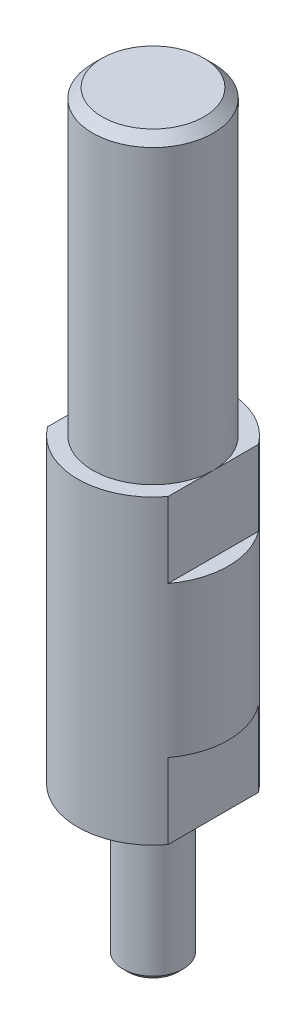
ISO-10303-21;
HEADER;
FILE_DESCRIPTION(('STEP AP214'),'2;1');
FILE_NAME('part.step','',(''),(''),'','','');
FILE_SCHEMA(('AUTOMOTIVE_DESIGN { 1 0 10303 214 1 1 1 1 }'));
ENDSEC;
DATA;
#1=APPLICATION_CONTEXT('core data for automotive mechanical design processes');
#2=APPLICATION_PROTOCOL_DEFINITION('international standard','automotive_design',2000,#1);
#3=PRODUCT_CONTEXT('',#1,'mechanical');
#4=PRODUCT('Part','Part','',(#3));
#5=PRODUCT_RELATED_PRODUCT_CATEGORY('part','',(#4));
#6=PRODUCT_DEFINITION_FORMATION('','',#4);
#7=PRODUCT_DEFINITION_CONTEXT('part definition',#1,'design');
#8=PRODUCT_DEFINITION('design','',#6,#7);
#9=PRODUCT_DEFINITION_SHAPE('','',#8);
#10=(LENGTH_UNIT() NAMED_UNIT(*) SI_UNIT(.MILLI.,.METRE.));
#11=(NAMED_UNIT(*) PLANE_ANGLE_UNIT() SI_UNIT($,.RADIAN.));
#12=(NAMED_UNIT(*) SI_UNIT($,.STERADIAN.) SOLID_ANGLE_UNIT());
#13=UNCERTAINTY_MEASURE_WITH_UNIT(LENGTH_MEASURE(1.E-05),#10,'distance_accuracy_value','');
#14=(GEOMETRIC_REPRESENTATION_CONTEXT(3) GLOBAL_UNCERTAINTY_ASSIGNED_CONTEXT((#13)) GLOBAL_UNIT_ASSIGNED_CONTEXT((#10,
#11,#12)) REPRESENTATION_CONTEXT('',''));
#15=CARTESIAN_POINT('',(0.,0.,0.));
#16=DIRECTION('',(0.,0.,1.));
#17=DIRECTION('',(1.,0.,0.));
#18=AXIS2_PLACEMENT_3D('',#15,#16,#17);
#19=CARTESIAN_POINT('',(0.,-30.,0.));
#20=DIRECTION('',(0.,-1.,0.));
#21=DIRECTION('',(1.,0.,0.));
#22=AXIS2_PLACEMENT_3D('',#19,#20,#21);
#23=CYLINDRICAL_SURFACE('',#22,5.);
#24=CARTESIAN_POINT('',(0.,-20.,0.));
#25=DIRECTION('',(0.,-1.,0.));
#26=DIRECTION('',(1.,0.,0.));
#27=AXIS2_PLACEMENT_3D('',#24,#25,#26);
#28=CIRCLE('',#27,5.);
#29=CARTESIAN_POINT('',(4.,-20.,3.));
#30=VERTEX_POINT('',#29);
#31=CARTESIAN_POINT('',(-4.,-20.,2.99999999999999));
#32=VERTEX_POINT('',#31);
#33=EDGE_CURVE('E139',#30,#32,#28,.T.);
#34=ORIENTED_EDGE('',*,*,#33,.F.);
#35=DIRECTION('',(0.,-1.,0.));
#36=VECTOR('',#35,1.);
#37=CARTESIAN_POINT('',(4.,-30.,3.));
#38=LINE('',#37,#36);
#39=CARTESIAN_POINT('',(4.,-15.,3.));
#40=VERTEX_POINT('',#39);
#41=EDGE_CURVE('E231',#30,#40,#38,.F.);
#42=ORIENTED_EDGE('',*,*,#41,.T.);
#43=CARTESIAN_POINT('',(0.,-15.,0.));
#44=DIRECTION('',(0.,-1.,0.));
#45=DIRECTION('',(1.,0.,0.));
#46=AXIS2_PLACEMENT_3D('',#43,#44,#45);
#47=CIRCLE('',#46,5.);
#48=CARTESIAN_POINT('',(4.,-15.,-3.));
#49=VERTEX_POINT('',#48);
#50=EDGE_CURVE('E159',#40,#49,#47,.F.);
#51=ORIENTED_EDGE('',*,*,#50,.T.);
#52=DIRECTION('',(0.,-1.,0.));
#53=VECTOR('',#52,1.);
#54=CARTESIAN_POINT('',(4.,-30.,-3.));
#55=LINE('',#54,#53);
#56=CARTESIAN_POINT('',(4.,-20.,-3.));
#57=VERTEX_POINT('',#56);
#58=EDGE_CURVE('E234',#49,#57,#55,.T.);
#59=ORIENTED_EDGE('',*,*,#58,.T.);
#60=CARTESIAN_POINT('',(-4.,-20.,-2.99999999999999));
#61=VERTEX_POINT('',#60);
#62=EDGE_CURVE('E144',#61,#57,#28,.T.);
#63=ORIENTED_EDGE('',*,*,#62,.F.);
#64=DIRECTION('',(0.,-1.,0.));
#65=VECTOR('',#64,1.);
#66=CARTESIAN_POINT('',(-4.,-30.,-3.));
#67=LINE('',#66,#65);
#68=CARTESIAN_POINT('',(-4.,-15.,-3.));
#69=VERTEX_POINT('',#68);
#70=EDGE_CURVE('E238',#61,#69,#67,.F.);
#71=ORIENTED_EDGE('',*,*,#70,.T.);
#72=CARTESIAN_POINT('',(-4.,-15.,2.99999999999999));
#73=VERTEX_POINT('',#72);
#74=EDGE_CURVE('E157',#69,#73,#47,.F.);
#75=ORIENTED_EDGE('',*,*,#74,.T.);
#76=DIRECTION('',(0.,-1.,0.));
#77=VECTOR('',#76,1.);
#78=CARTESIAN_POINT('',(-4.,-30.,2.99999999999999));
#79=LINE('',#78,#77);
#80=EDGE_CURVE('E240',#73,#32,#79,.T.);
#81=ORIENTED_EDGE('',*,*,#80,.T.);
#82=EDGE_LOOP('',(#34,#42,#51,#59,#63,#71,#75,#81));
#83=FACE_BOUND('',#82,.T.);
#84=CARTESIAN_POINT('',(0.,-5.,0.));
#85=DIRECTION('',(0.,1.,0.));
#86=DIRECTION('',(-1.,0.,0.));
#87=AXIS2_PLACEMENT_3D('',#84,#85,#86);
#88=CIRCLE('',#87,5.);
#89=CARTESIAN_POINT('',(4.,-5.,-3.));
#90=VERTEX_POINT('',#89);
#91=CARTESIAN_POINT('',(4.,-5.,3.));
#92=VERTEX_POINT('',#91);
#93=EDGE_CURVE('E164',#90,#92,#88,.F.);
#94=ORIENTED_EDGE('',*,*,#93,.T.);
#95=DIRECTION('',(0.,-1.,0.));
#96=VECTOR('',#95,1.);
#97=CARTESIAN_POINT('',(4.00000000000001,-30.,3.));
#98=LINE('',#97,#96);
#99=CARTESIAN_POINT('',(4.,0.,3.));
#100=VERTEX_POINT('',#99);
#101=EDGE_CURVE('E249',#92,#100,#98,.F.);
#102=ORIENTED_EDGE('',*,*,#101,.T.);
#103=CARTESIAN_POINT('',(0.,0.,0.));
#104=DIRECTION('',(0.,-1.,0.));
#105=DIRECTION('',(1.,0.,0.));
#106=AXIS2_PLACEMENT_3D('',#103,#104,#105);
#107=CIRCLE('',#106,5.);
#108=CARTESIAN_POINT('',(-4.,0.,3.));
#109=VERTEX_POINT('',#108);
#110=EDGE_CURVE('E138',#100,#109,#107,.T.);
#111=ORIENTED_EDGE('',*,*,#110,.T.);
#112=DIRECTION('',(0.,-1.,0.));
#113=VECTOR('',#112,1.);
#114=CARTESIAN_POINT('',(-3.99999999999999,-30.,3.));
#115=LINE('',#114,#113);
#116=CARTESIAN_POINT('',(-4.,-5.,3.));
#117=VERTEX_POINT('',#116);
#118=EDGE_CURVE('E70',#109,#117,#115,.T.);
#119=ORIENTED_EDGE('',*,*,#118,.T.);
#120=CARTESIAN_POINT('',(-4.,-5.,-3.));
#121=VERTEX_POINT('',#120);
#122=EDGE_CURVE('E135',#117,#121,#88,.F.);
#123=ORIENTED_EDGE('',*,*,#122,.T.);
#124=DIRECTION('',(0.,-1.,0.));
#125=VECTOR('',#124,1.);
#126=CARTESIAN_POINT('',(-3.99999999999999,-30.,-3.));
#127=LINE('',#126,#125);
#128=CARTESIAN_POINT('',(-4.,0.,-3.));
#129=VERTEX_POINT('',#128);
#130=EDGE_CURVE('E121',#121,#129,#127,.F.);
#131=ORIENTED_EDGE('',*,*,#130,.T.);
#132=CARTESIAN_POINT('',(4.,0.,-3.));
#133=VERTEX_POINT('',#132);
#134=EDGE_CURVE('E134',#129,#133,#107,.T.);
#135=ORIENTED_EDGE('',*,*,#134,.T.);
#136=DIRECTION('',(0.,-1.,0.));
#137=VECTOR('',#136,1.);
#138=CARTESIAN_POINT('',(4.00000000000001,-30.,-3.));
#139=LINE('',#138,#137);
#140=EDGE_CURVE('E62',#133,#90,#139,.T.);
#141=ORIENTED_EDGE('',*,*,#140,.T.);
#142=EDGE_LOOP('',(#94,#102,#111,#119,#123,#131,#135,#141));
#143=FACE_BOUND('',#142,.T.);
#144=ADVANCED_FACE('F47',(#83,#143),#23,.T.);
#145=CARTESIAN_POINT('',(4.,0.,0.));
#146=DIRECTION('',(0.,1.,0.));
#147=DIRECTION('',(-1.,0.,0.));
#148=AXIS2_PLACEMENT_3D('',#145,#146,#147);
#149=PLANE('',#148);
#150=ORIENTED_EDGE('',*,*,#110,.F.);
#151=DIRECTION('',(0.,0.,-1.));
#152=VECTOR('',#151,1.);
#153=CARTESIAN_POINT('',(4.,0.,0.));
#154=LINE('',#153,#152);
#155=CARTESIAN_POINT('',(4.,0.,0.));
#156=VERTEX_POINT('',#155);
#157=EDGE_CURVE('E162',#100,#156,#154,.T.);
#158=ORIENTED_EDGE('',*,*,#157,.T.);
#159=CARTESIAN_POINT('',(0.,0.,0.));
#160=DIRECTION('',(0.,-1.,0.));
#161=DIRECTION('',(1.,0.,0.));
#162=AXIS2_PLACEMENT_3D('',#159,#160,#161);
#163=CIRCLE('',#162,4.);
#164=CARTESIAN_POINT('',(-4.,0.,0.));
#165=VERTEX_POINT('',#164);
#166=EDGE_CURVE('E148',#156,#165,#163,.T.);
#167=ORIENTED_EDGE('',*,*,#166,.T.);
#168=DIRECTION('',(0.,0.,1.));
#169=VECTOR('',#168,1.);
#170=CARTESIAN_POINT('',(-4.,0.,0.));
#171=LINE('',#170,#169);
#172=EDGE_CURVE('E123',#165,#109,#171,.T.);
#173=ORIENTED_EDGE('',*,*,#172,.T.);
#174=EDGE_LOOP('',(#150,#158,#167,#173));
#175=FACE_BOUND('',#174,.T.);
#176=ADVANCED_FACE('F187',(#175),#149,.T.);
#177=EDGE_CURVE('E142',#165,#156,#163,.T.);
#178=ORIENTED_EDGE('',*,*,#177,.T.);
#179=EDGE_CURVE('E128',#156,#133,#154,.T.);
#180=ORIENTED_EDGE('',*,*,#179,.T.);
#181=ORIENTED_EDGE('',*,*,#134,.F.);
#182=EDGE_CURVE('E118',#129,#165,#171,.T.);
#183=ORIENTED_EDGE('',*,*,#182,.T.);
#184=EDGE_LOOP('',(#178,#180,#181,#183));
#185=FACE_BOUND('',#184,.T.);
#186=ADVANCED_FACE('F137',(#185),#149,.T.);
#187=CARTESIAN_POINT('',(5.,-20.,0.));
#188=DIRECTION('',(0.,-1.,0.));
#189=DIRECTION('',(1.,0.,0.));
#190=AXIS2_PLACEMENT_3D('',#187,#188,#189);
#191=PLANE('',#190);
#192=CARTESIAN_POINT('',(0.,-20.,0.));
#193=DIRECTION('',(0.,-1.,0.));
#194=DIRECTION('',(1.,0.,0.));
#195=AXIS2_PLACEMENT_3D('',#192,#193,#194);
#196=CIRCLE('',#195,2.);
#197=CARTESIAN_POINT('',(2.,-20.,0.));
#198=VERTEX_POINT('',#197);
#199=EDGE_CURVE('E226',#198,#198,#196,.T.);
#200=ORIENTED_EDGE('',*,*,#199,.F.);
#201=EDGE_LOOP('',(#200));
#202=FACE_BOUND('',#201,.T.);
#203=ORIENTED_EDGE('',*,*,#62,.T.);
#204=DIRECTION('',(0.,0.,1.));
#205=VECTOR('',#204,1.);
#206=CARTESIAN_POINT('',(4.,-20.,0.));
#207=LINE('',#206,#205);
#208=EDGE_CURVE('E154',#57,#30,#207,.T.);
#209=ORIENTED_EDGE('',*,*,#208,.T.);
#210=ORIENTED_EDGE('',*,*,#33,.T.);
#211=DIRECTION('',(0.,0.,-1.));
#212=VECTOR('',#211,1.);
#213=CARTESIAN_POINT('',(-4.,-20.,0.));
#214=LINE('',#213,#212);
#215=EDGE_CURVE('E151',#32,#61,#214,.T.);
#216=ORIENTED_EDGE('',*,*,#215,.T.);
#217=EDGE_LOOP('',(#203,#209,#210,#216));
#218=FACE_BOUND('',#217,.T.);
#219=ADVANCED_FACE('F198',(#202,#218),#191,.T.);
#220=CARTESIAN_POINT('',(2.00000000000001,-30.,0.));
#221=DIRECTION('',(0.,-1.,0.));
#222=DIRECTION('',(1.,0.,0.));
#223=AXIS2_PLACEMENT_3D('',#220,#221,#222);
#224=PLANE('',#223);
#225=CARTESIAN_POINT('',(0.,-30.,0.));
#226=DIRECTION('',(0.,-1.,0.));
#227=DIRECTION('',(1.,0.,0.));
#228=AXIS2_PLACEMENT_3D('',#225,#226,#227);
#229=CIRCLE('',#228,1.65);
#230=CARTESIAN_POINT('',(1.65,-30.,0.));
#231=VERTEX_POINT('',#230);
#232=EDGE_CURVE('E165',#231,#231,#229,.T.);
#233=ORIENTED_EDGE('',*,*,#232,.T.);
#234=EDGE_LOOP('',(#233));
#235=FACE_BOUND('',#234,.T.);
#236=ADVANCED_FACE('F207',(#235),#224,.T.);
#237=CARTESIAN_POINT('',(0.,20.,0.));
#238=DIRECTION('',(0.,1.,0.));
#239=DIRECTION('',(-1.,0.,0.));
#240=AXIS2_PLACEMENT_3D('',#237,#238,#239);
#241=PLANE('',#240);
#242=CARTESIAN_POINT('',(0.,20.,0.));
#243=DIRECTION('',(0.,1.,0.));
#244=DIRECTION('',(-1.,0.,0.));
#245=AXIS2_PLACEMENT_3D('',#242,#243,#244);
#246=CIRCLE('',#245,3.37499999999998);
#247=CARTESIAN_POINT('',(-3.37499999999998,20.,0.));
#248=VERTEX_POINT('',#247);
#249=EDGE_CURVE('E12',#248,#248,#246,.T.);
#250=ORIENTED_EDGE('',*,*,#249,.T.);
#251=EDGE_LOOP('',(#250));
#252=FACE_BOUND('',#251,.T.);
#253=ADVANCED_FACE('F204',(#252),#241,.T.);
#254=CARTESIAN_POINT('',(0.,-30.,0.));
#255=DIRECTION('',(0.,-1.,0.));
#256=DIRECTION('',(1.,0.,0.));
#257=AXIS2_PLACEMENT_3D('',#254,#255,#256);
#258=CYLINDRICAL_SURFACE('',#257,4.);
#259=CARTESIAN_POINT('',(0.,19.375,0.));
#260=DIRECTION('',(0.,1.,0.));
#261=DIRECTION('',(-1.,0.,0.));
#262=AXIS2_PLACEMENT_3D('',#259,#260,#261);
#263=CIRCLE('',#262,4.);
#264=CARTESIAN_POINT('',(-4.,19.375,0.));
#265=VERTEX_POINT('',#264);
#266=EDGE_CURVE('E55',#265,#265,#263,.F.);
#267=ORIENTED_EDGE('',*,*,#266,.T.);
#268=EDGE_LOOP('',(#267));
#269=FACE_BOUND('',#268,.T.);
#270=ORIENTED_EDGE('',*,*,#166,.F.);
#271=ORIENTED_EDGE('',*,*,#177,.F.);
#272=EDGE_LOOP('',(#270,#271));
#273=FACE_BOUND('',#272,.T.);
#274=ADVANCED_FACE('F173',(#269,#273),#258,.T.);
#275=CARTESIAN_POINT('',(0.,-30.,0.));
#276=DIRECTION('',(0.,-1.,0.));
#277=DIRECTION('',(1.,0.,0.));
#278=AXIS2_PLACEMENT_3D('',#275,#276,#277);
#279=CYLINDRICAL_SURFACE('',#278,2.);
#280=CARTESIAN_POINT('',(0.,-29.65,0.));
#281=DIRECTION('',(0.,-1.,0.));
#282=DIRECTION('',(1.,0.,0.));
#283=AXIS2_PLACEMENT_3D('',#280,#281,#282);
#284=CIRCLE('',#283,2.);
#285=CARTESIAN_POINT('',(2.00000000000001,-29.65,0.));
#286=VERTEX_POINT('',#285);
#287=EDGE_CURVE('E168',#286,#286,#284,.F.);
#288=ORIENTED_EDGE('',*,*,#287,.T.);
#289=EDGE_LOOP('',(#288));
#290=FACE_BOUND('',#289,.T.);
#291=ORIENTED_EDGE('',*,*,#199,.T.);
#292=EDGE_LOOP('',(#291));
#293=FACE_BOUND('',#292,.T.);
#294=ADVANCED_FACE('F203',(#290,#293),#279,.T.);
#295=CARTESIAN_POINT('',(-4.,-15.,5.35043025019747));
#296=DIRECTION('',(-1.,0.,0.));
#297=DIRECTION('',(0.,-1.,0.));
#298=AXIS2_PLACEMENT_3D('',#295,#296,#297);
#299=PLANE('',#298);
#300=ORIENTED_EDGE('',*,*,#215,.F.);
#301=ORIENTED_EDGE('',*,*,#80,.F.);
#302=DIRECTION('',(0.,0.,-1.));
#303=VECTOR('',#302,1.);
#304=CARTESIAN_POINT('',(-4.,-15.,5.35043025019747));
#305=LINE('',#304,#303);
#306=EDGE_CURVE('E243',#73,#69,#305,.T.);
#307=ORIENTED_EDGE('',*,*,#306,.T.);
#308=ORIENTED_EDGE('',*,*,#70,.F.);
#309=EDGE_LOOP('',(#300,#301,#307,#308));
#310=FACE_BOUND('',#309,.T.);
#311=ADVANCED_FACE('F271',(#310),#299,.T.);
#312=CARTESIAN_POINT('',(0.,-15.,0.));
#313=DIRECTION('',(0.,-1.,0.));
#314=DIRECTION('',(1.,0.,0.));
#315=AXIS2_PLACEMENT_3D('',#312,#313,#314);
#316=PLANE('',#315);
#317=ORIENTED_EDGE('',*,*,#306,.F.);
#318=ORIENTED_EDGE('',*,*,#74,.F.);
#319=EDGE_LOOP('',(#317,#318));
#320=FACE_BOUND('',#319,.T.);
#321=ADVANCED_FACE('F273',(#320),#316,.T.);
#322=DIRECTION('',(0.,0.,1.));
#323=VECTOR('',#322,1.);
#324=CARTESIAN_POINT('',(4.,-15.,5.35043025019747));
#325=LINE('',#324,#323);
#326=EDGE_CURVE('E246',#49,#40,#325,.T.);
#327=ORIENTED_EDGE('',*,*,#326,.F.);
#328=ORIENTED_EDGE('',*,*,#50,.F.);
#329=EDGE_LOOP('',(#327,#328));
#330=FACE_BOUND('',#329,.T.);
#331=ADVANCED_FACE('F277',(#330),#316,.T.);
#332=CARTESIAN_POINT('',(4.,-15.,5.35043025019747));
#333=DIRECTION('',(1.,0.,0.));
#334=DIRECTION('',(0.,1.,0.));
#335=AXIS2_PLACEMENT_3D('',#332,#333,#334);
#336=PLANE('',#335);
#337=ORIENTED_EDGE('',*,*,#208,.F.);
#338=ORIENTED_EDGE('',*,*,#58,.F.);
#339=ORIENTED_EDGE('',*,*,#326,.T.);
#340=ORIENTED_EDGE('',*,*,#41,.F.);
#341=EDGE_LOOP('',(#337,#338,#339,#340));
#342=FACE_BOUND('',#341,.T.);
#343=ADVANCED_FACE('F275',(#342),#336,.T.);
#344=CARTESIAN_POINT('',(-4.,-5.,-5.49701738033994));
#345=DIRECTION('',(-1.,0.,0.));
#346=DIRECTION('',(0.,-1.,0.));
#347=AXIS2_PLACEMENT_3D('',#344,#345,#346);
#348=PLANE('',#347);
#349=DIRECTION('',(0.,0.,1.));
#350=VECTOR('',#349,1.);
#351=CARTESIAN_POINT('',(-4.,-5.,-5.49701738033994));
#352=LINE('',#351,#350);
#353=EDGE_CURVE('E254',#121,#117,#352,.T.);
#354=ORIENTED_EDGE('',*,*,#353,.T.);
#355=ORIENTED_EDGE('',*,*,#118,.F.);
#356=ORIENTED_EDGE('',*,*,#172,.F.);
#357=ORIENTED_EDGE('',*,*,#182,.F.);
#358=ORIENTED_EDGE('',*,*,#130,.F.);
#359=EDGE_LOOP('',(#354,#355,#356,#357,#358));
#360=FACE_BOUND('',#359,.T.);
#361=ADVANCED_FACE('F120',(#360),#348,.T.);
#362=CARTESIAN_POINT('',(0.,-5.,0.));
#363=DIRECTION('',(0.,1.,0.));
#364=DIRECTION('',(-1.,0.,0.));
#365=AXIS2_PLACEMENT_3D('',#362,#363,#364);
#366=PLANE('',#365);
#367=ORIENTED_EDGE('',*,*,#353,.F.);
#368=ORIENTED_EDGE('',*,*,#122,.F.);
#369=EDGE_LOOP('',(#367,#368));
#370=FACE_BOUND('',#369,.T.);
#371=ADVANCED_FACE('F262',(#370),#366,.T.);
#372=DIRECTION('',(0.,0.,-1.));
#373=VECTOR('',#372,1.);
#374=CARTESIAN_POINT('',(4.,-5.,-5.49701738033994));
#375=LINE('',#374,#373);
#376=EDGE_CURVE('E256',#92,#90,#375,.T.);
#377=ORIENTED_EDGE('',*,*,#376,.F.);
#378=ORIENTED_EDGE('',*,*,#93,.F.);
#379=EDGE_LOOP('',(#377,#378));
#380=FACE_BOUND('',#379,.T.);
#381=ADVANCED_FACE('F260',(#380),#366,.T.);
#382=CARTESIAN_POINT('',(4.,-5.,-5.49701738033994));
#383=DIRECTION('',(1.,0.,0.));
#384=DIRECTION('',(0.,1.,0.));
#385=AXIS2_PLACEMENT_3D('',#382,#383,#384);
#386=PLANE('',#385);
#387=ORIENTED_EDGE('',*,*,#376,.T.);
#388=ORIENTED_EDGE('',*,*,#140,.F.);
#389=ORIENTED_EDGE('',*,*,#179,.F.);
#390=ORIENTED_EDGE('',*,*,#157,.F.);
#391=ORIENTED_EDGE('',*,*,#101,.F.);
#392=EDGE_LOOP('',(#387,#388,#389,#390,#391));
#393=FACE_BOUND('',#392,.T.);
#394=ADVANCED_FACE('F183',(#393),#386,.T.);
#395=CARTESIAN_POINT('',(0.,-30.,0.));
#396=DIRECTION('',(0.,1.,0.));
#397=DIRECTION('',(-1.,0.,0.));
#398=AXIS2_PLACEMENT_3D('',#395,#396,#397);
#399=CONICAL_SURFACE('',#398,1.65,0.785398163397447);
#400=ORIENTED_EDGE('',*,*,#287,.F.);
#401=EDGE_LOOP('',(#400));
#402=FACE_BOUND('',#401,.T.);
#403=ORIENTED_EDGE('',*,*,#232,.F.);
#404=EDGE_LOOP('',(#403));
#405=FACE_BOUND('',#404,.T.);
#406=ADVANCED_FACE('F177',(#402,#405),#399,.T.);
#407=CARTESIAN_POINT('',(0.,19.375,0.));
#408=DIRECTION('',(0.,-1.,0.));
#409=DIRECTION('',(1.,0.,0.));
#410=AXIS2_PLACEMENT_3D('',#407,#408,#409);
#411=CONICAL_SURFACE('',#410,4.,0.785398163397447);
#412=ORIENTED_EDGE('',*,*,#249,.F.);
#413=EDGE_LOOP('',(#412));
#414=FACE_BOUND('',#413,.T.);
#415=ORIENTED_EDGE('',*,*,#266,.F.);
#416=EDGE_LOOP('',(#415));
#417=FACE_BOUND('',#416,.T.);
#418=ADVANCED_FACE('F49',(#414,#417),#411,.T.);
#419=CLOSED_SHELL('',(#144,#176,#186,#219,#236,#253,#274,#294,#311,#321,#331,#343,#361,#371,
#381,#394,#406,#418));
#420=MANIFOLD_SOLID_BREP('B2',#419);
#421=ADVANCED_BREP_SHAPE_REPRESENTATION('',(#18,#420),#14);
#422=SHAPE_DEFINITION_REPRESENTATION(#9,#421);
ENDSEC;
END-ISO-10303-21;
